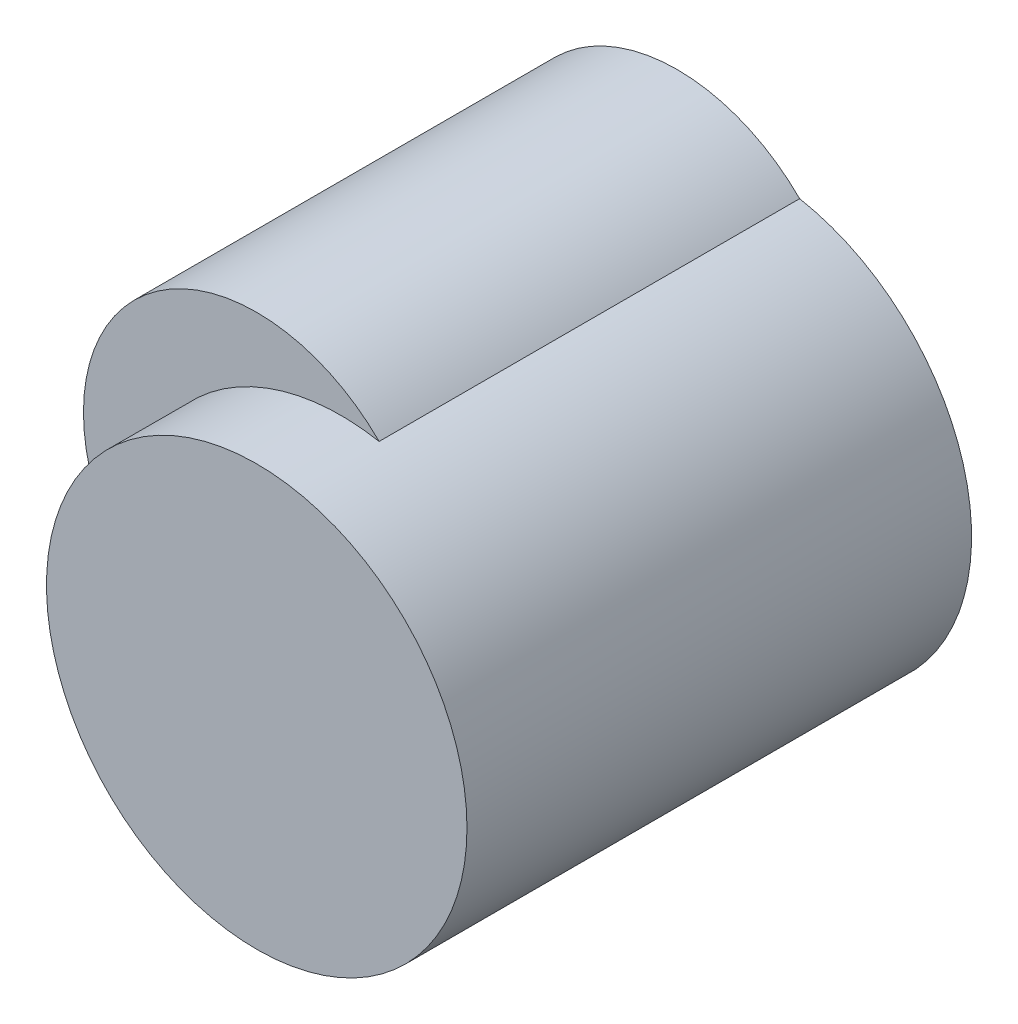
from build123d import *

# Parameters (mm, degrees)
SKETCH_1_R      = 25
EXTRUDE_1_DEPTH = 60
SKETCH_2_R      = 20.60241203
EXTRUDE_2_DEPTH = 50


with BuildPart() as part:
    # Sketch 1 → Extrude 1 (new body)
    with BuildSketch(Plane.XY):
        Circle(SKETCH_1_R)
    extrude(amount=EXTRUDE_1_DEPTH)

    # Sketch 2 → Extrude 2 (add)
    with BuildSketch(Plane.XY):
        with Locations((-10, 10)):
            Circle(SKETCH_2_R)
    extrude(amount=EXTRUDE_2_DEPTH)


solid = part.part
